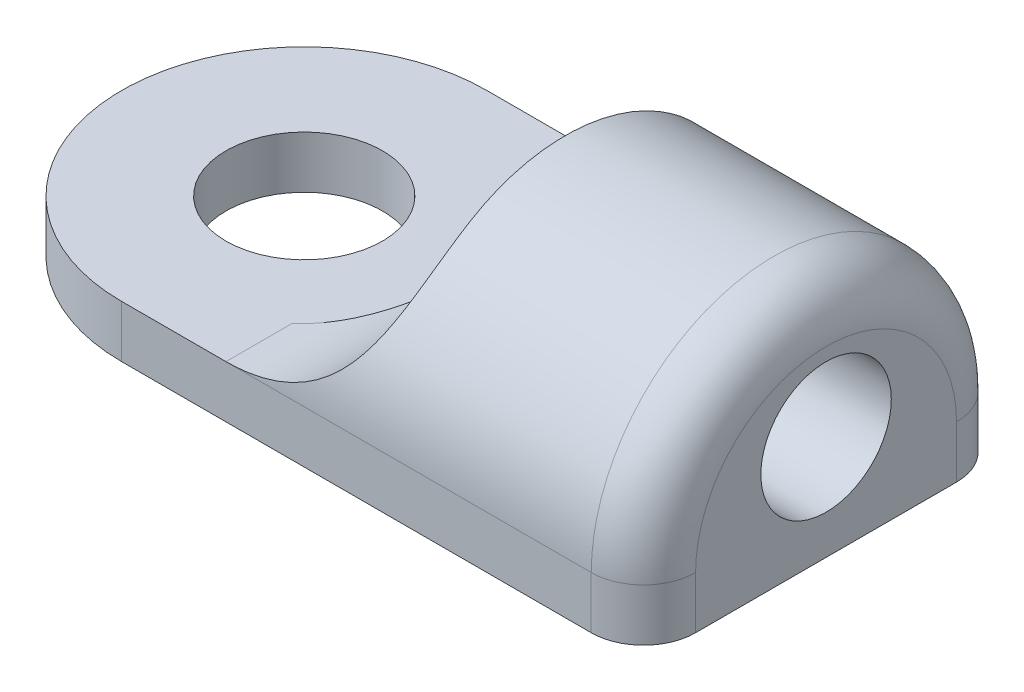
ISO-10303-21;
HEADER;
FILE_DESCRIPTION(('STEP AP214'),'2;1');
FILE_NAME('part.step','',(''),(''),'','','');
FILE_SCHEMA(('AUTOMOTIVE_DESIGN { 1 0 10303 214 1 1 1 1 }'));
ENDSEC;
DATA;
#1=APPLICATION_CONTEXT('core data for automotive mechanical design processes');
#2=APPLICATION_PROTOCOL_DEFINITION('international standard','automotive_design',2000,#1);
#3=PRODUCT_CONTEXT('',#1,'mechanical');
#4=PRODUCT('Part','Part','',(#3));
#5=PRODUCT_RELATED_PRODUCT_CATEGORY('part','',(#4));
#6=PRODUCT_DEFINITION_FORMATION('','',#4);
#7=PRODUCT_DEFINITION_CONTEXT('part definition',#1,'design');
#8=PRODUCT_DEFINITION('design','',#6,#7);
#9=PRODUCT_DEFINITION_SHAPE('','',#8);
#10=(LENGTH_UNIT() NAMED_UNIT(*) SI_UNIT(.MILLI.,.METRE.));
#11=(NAMED_UNIT(*) PLANE_ANGLE_UNIT() SI_UNIT($,.RADIAN.));
#12=(NAMED_UNIT(*) SI_UNIT($,.STERADIAN.) SOLID_ANGLE_UNIT());
#13=UNCERTAINTY_MEASURE_WITH_UNIT(LENGTH_MEASURE(1.E-05),#10,'distance_accuracy_value','');
#14=(GEOMETRIC_REPRESENTATION_CONTEXT(3) GLOBAL_UNCERTAINTY_ASSIGNED_CONTEXT((#13)) GLOBAL_UNIT_ASSIGNED_CONTEXT((#10,
#11,#12)) REPRESENTATION_CONTEXT('',''));
#15=CARTESIAN_POINT('',(0.,0.,0.));
#16=DIRECTION('',(0.,0.,1.));
#17=DIRECTION('',(1.,0.,0.));
#18=AXIS2_PLACEMENT_3D('',#15,#16,#17);
#19=CARTESIAN_POINT('',(1.99999999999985,4.,0.));
#20=DIRECTION('',(0.,0.,-1.));
#21=DIRECTION('',(-1.,0.,0.));
#22=AXIS2_PLACEMENT_3D('',#19,#20,#21);
#23=CYLINDRICAL_SURFACE('',#22,3.);
#24=CARTESIAN_POINT('',(1.80565399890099,1.00630167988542,2.39862057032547));
#25=CARTESIAN_POINT('',(1.88048617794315,1.00142895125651,2.34010039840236));
#26=CARTESIAN_POINT('',(1.95326958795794,0.99953534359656,2.27877300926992));
#27=CARTESIAN_POINT('',(2.09390884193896,1.00065013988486,2.15080450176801));
#28=CARTESIAN_POINT('',(2.16176697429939,1.00365625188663,2.08416588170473));
#29=CARTESIAN_POINT('',(2.29210998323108,1.01353538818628,1.94548751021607));
#30=CARTESIAN_POINT('',(2.35456743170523,1.02042695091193,1.87342331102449));
#31=CARTESIAN_POINT('',(2.47304514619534,1.03692570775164,1.724505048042));
#32=CARTESIAN_POINT('',(2.52906512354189,1.04653302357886,1.64765076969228));
#33=CARTESIAN_POINT('',(2.68003431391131,1.07637150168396,1.4200797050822));
#34=CARTESIAN_POINT('',(2.76614222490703,1.09854145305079,1.26358923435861));
#35=CARTESIAN_POINT('',(2.9086596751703,1.13994502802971,0.937724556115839));
#36=CARTESIAN_POINT('',(2.965173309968,1.15918877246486,0.768397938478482));
#37=CARTESIAN_POINT('',(3.0361270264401,1.18441005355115,0.457212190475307));
#38=CARTESIAN_POINT('',(3.05686899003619,1.19231314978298,0.316955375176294));
#39=CARTESIAN_POINT('',(3.07564437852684,1.19944410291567,0.0347076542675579));
#40=CARTESIAN_POINT('',(3.07368764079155,1.19867571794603,-0.107282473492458));
#41=CARTESIAN_POINT('',(3.04725546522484,1.18869562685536,-0.388533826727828));
#42=CARTESIAN_POINT('',(3.02281900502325,1.1794985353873,-0.527799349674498));
#43=CARTESIAN_POINT('',(2.95315462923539,1.15520993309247,-0.800533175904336));
#44=CARTESIAN_POINT('',(2.90790397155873,1.14011197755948,-0.933994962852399));
#45=CARTESIAN_POINT('',(2.79527147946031,1.10669713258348,-1.20140234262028));
#46=CARTESIAN_POINT('',(2.72661640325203,1.08823282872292,-1.33478816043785));
#47=CARTESIAN_POINT('',(2.57098893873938,1.05376235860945,-1.59065760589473));
#48=CARTESIAN_POINT('',(2.48401893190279,1.03775587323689,-1.71314264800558));
#49=CARTESIAN_POINT('',(2.30336214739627,1.01412535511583,-1.93489098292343));
#50=CARTESIAN_POINT('',(2.21111547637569,1.00584553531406,-2.03525481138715));
#51=CARTESIAN_POINT('',(2.06469619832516,1.0002990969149,-2.17768874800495));
#52=CARTESIAN_POINT('',(2.01454068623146,0.999596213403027,-2.22382061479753));
#53=CARTESIAN_POINT('',(1.91182496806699,1.00085563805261,-2.31331794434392));
#54=CARTESIAN_POINT('',(1.85926400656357,1.0028187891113,-2.35668252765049));
#55=CARTESIAN_POINT('',(1.80565399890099,1.00630167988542,-2.39862057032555));
#56=B_SPLINE_CURVE_WITH_KNOTS('',3,(#24,#25,#26,#27,#28,#29,#30,#31,#32,#33,#34,#35,#36,#37,#38,
#39,#40,#41,#42,#43,#44,#45,#46,#47,#48,#49,#50,#51,#52,#53,#54,#55),.UNSPECIFIED.,.F.,.F.,(4,2,
2,2,2,2,2,2,2,2,2,2,2,2,2,4),(0.,0.285203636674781,0.570273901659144,0.856715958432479,
1.14317085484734,1.68034204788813,2.21561087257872,2.63967088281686,3.06354711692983,
3.48668977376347,3.91029586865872,4.36211458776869,4.81387459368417,5.22238574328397,
5.42669819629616,5.63107526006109),.UNSPECIFIED.);
#57=CARTESIAN_POINT('',(2.,0.999999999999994,2.23606797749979));
#58=VERTEX_POINT('',#57);
#59=CARTESIAN_POINT('',(2.,0.999999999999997,-2.23606797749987));
#60=VERTEX_POINT('',#59);
#61=EDGE_CURVE('E106',#58,#60,#56,.T.);
#62=ORIENTED_EDGE('',*,*,#61,.F.);
#63=DIRECTION('',(0.,0.,-1.));
#64=VECTOR('',#63,1.);
#65=CARTESIAN_POINT('',(2.,0.999999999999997,0.));
#66=LINE('',#65,#64);
#67=CARTESIAN_POINT('',(2.,0.999999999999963,3.5));
#68=VERTEX_POINT('',#67);
#69=EDGE_CURVE('E117',#68,#58,#66,.T.);
#70=ORIENTED_EDGE('',*,*,#69,.F.);
#71=CARTESIAN_POINT('',(4.99999999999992,4.,1.80277563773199));
#72=CARTESIAN_POINT('',(4.99999442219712,3.9576820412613,1.87321692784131));
#73=CARTESIAN_POINT('',(4.99910426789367,3.91285624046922,1.94217352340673));
#74=CARTESIAN_POINT('',(4.99487733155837,3.81847183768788,2.07676644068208));
#75=CARTESIAN_POINT('',(4.99153862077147,3.76890953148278,2.14240010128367));
#76=CARTESIAN_POINT('',(4.98170444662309,3.66508047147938,2.2702808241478));
#77=CARTESIAN_POINT('',(4.97518945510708,3.61078634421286,2.33250425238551));
#78=CARTESIAN_POINT('',(4.95828761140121,3.49823110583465,2.45267502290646));
#79=CARTESIAN_POINT('',(4.94790172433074,3.43997098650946,2.51062342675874));
#80=CARTESIAN_POINT('',(4.9224891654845,3.31966175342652,2.62220196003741));
#81=CARTESIAN_POINT('',(4.90743254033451,3.25759032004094,2.67580131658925));
#82=CARTESIAN_POINT('',(4.87206691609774,3.13076888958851,2.77784915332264));
#83=CARTESIAN_POINT('',(4.8517586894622,3.06601928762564,2.8262983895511));
#84=CARTESIAN_POINT('',(4.8054536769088,2.93499388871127,2.91755864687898));
#85=CARTESIAN_POINT('',(4.77947874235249,2.86872480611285,2.96039034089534));
#86=CARTESIAN_POINT('',(4.72143855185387,2.73546449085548,3.04042789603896));
#87=CARTESIAN_POINT('',(4.68937428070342,2.66847337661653,3.07763466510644));
#88=CARTESIAN_POINT('',(4.62327625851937,2.54300946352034,3.14220940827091));
#89=CARTESIAN_POINT('',(4.58995621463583,2.48449148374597,3.17022362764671));
#90=CARTESIAN_POINT('',(4.51849747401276,2.36849391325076,3.22199620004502));
#91=CARTESIAN_POINT('',(4.48035723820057,2.31101466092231,3.2457531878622));
#92=CARTESIAN_POINT('',(4.39936469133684,2.19780876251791,3.28921467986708));
#93=CARTESIAN_POINT('',(4.35650928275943,2.14208329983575,3.30891649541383));
#94=CARTESIAN_POINT('',(4.26633150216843,2.03308427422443,3.34455222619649));
#95=CARTESIAN_POINT('',(4.21900738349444,1.97981168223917,3.36048465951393));
#96=CARTESIAN_POINT('',(4.07489047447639,1.82892670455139,3.40197545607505));
#97=CARTESIAN_POINT('',(3.97245792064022,1.735349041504,3.42300086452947));
#98=CARTESIAN_POINT('',(3.75477960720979,1.56276831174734,3.45558120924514));
#99=CARTESIAN_POINT('',(3.63953242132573,1.48376687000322,3.46713509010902));
#100=CARTESIAN_POINT('',(3.38742892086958,1.33572381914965,3.4847338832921));
#101=CARTESIAN_POINT('',(3.24955974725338,1.2683312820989,3.49015428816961));
#102=CARTESIAN_POINT('',(2.96507876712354,1.15534589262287,3.49701235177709));
#103=CARTESIAN_POINT('',(2.81846646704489,1.10975427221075,3.49844978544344));
#104=CARTESIAN_POINT('',(2.55951164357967,1.05048514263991,3.49972289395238));
#105=CARTESIAN_POINT('',(2.44834887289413,1.03155828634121,3.4998814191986));
#106=CARTESIAN_POINT('',(2.28066082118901,1.01262814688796,3.4999824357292));
#107=CARTESIAN_POINT('',(2.22464202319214,1.00789480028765,3.49999334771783));
#108=CARTESIAN_POINT('',(2.1124185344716,1.00158016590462,3.50000023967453));
#109=CARTESIAN_POINT('',(2.05621381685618,0.999999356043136,3.49999621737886));
#110=CARTESIAN_POINT('',(2.,0.999999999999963,3.5));
#111=B_SPLINE_CURVE_WITH_KNOTS('',3,(#71,#72,#73,#74,#75,#76,#77,#78,#79,#80,#81,#82,#83,#84,
#85,#86,#87,#88,#89,#90,#91,#92,#93,#94,#95,#96,#97,#98,#99,#100,#101,#102,#103,#104,#105,#106,
#107,#108,#109,#110),.UNSPECIFIED.,.F.,.F.,(4,2,2,2,2,2,2,2,2,2,2,2,2,2,2,2,2,2,2,4),(0.,
0.246499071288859,0.493192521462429,0.741422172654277,0.989589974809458,1.2393833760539,
1.48914005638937,1.73795015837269,1.98672005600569,2.20523703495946,2.42382396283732,
2.64255535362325,2.8613725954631,3.2804260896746,3.69952627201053,4.15827123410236,
4.61704211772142,4.95460521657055,5.12318077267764,5.29178188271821),.UNSPECIFIED.);
#112=CARTESIAN_POINT('',(4.99999999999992,4.,1.80277563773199));
#113=VERTEX_POINT('',#112);
#114=EDGE_CURVE('E121',#113,#68,#111,.T.);
#115=ORIENTED_EDGE('',*,*,#114,.F.);
#116=DIRECTION('',(0.,0.,-1.));
#117=VECTOR('',#116,1.);
#118=CARTESIAN_POINT('',(4.99999999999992,4.,0.));
#119=LINE('',#118,#117);
#120=CARTESIAN_POINT('',(4.99999999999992,4.,-1.80277563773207));
#121=VERTEX_POINT('',#120);
#122=EDGE_CURVE('E129',#121,#113,#119,.F.);
#123=ORIENTED_EDGE('',*,*,#122,.F.);
#124=CARTESIAN_POINT('',(2.,0.999999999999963,-3.50000000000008));
#125=CARTESIAN_POINT('',(2.08374239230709,0.999991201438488,-3.49997769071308));
#126=CARTESIAN_POINT('',(2.16748354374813,1.00350602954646,-3.49999929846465));
#127=CARTESIAN_POINT('',(2.3343781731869,1.01751957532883,-3.49996912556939));
#128=CARTESIAN_POINT('',(2.41753166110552,1.0280181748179,-3.49991734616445));
#129=CARTESIAN_POINT('',(2.58275778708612,1.05595097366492,-3.49957900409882));
#130=CARTESIAN_POINT('',(2.66482916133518,1.07339264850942,-3.49929218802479));
#131=CARTESIAN_POINT('',(2.8272195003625,1.11508510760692,-3.49816993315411));
#132=CARTESIAN_POINT('',(2.90753848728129,1.1393358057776,-3.4973345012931));
#133=CARTESIAN_POINT('',(3.06592847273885,1.19449898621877,-3.49470056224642));
#134=CARTESIAN_POINT('',(3.14399721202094,1.22541791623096,-3.49290112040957));
#135=CARTESIAN_POINT('',(3.29722876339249,1.2936683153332,-3.48782588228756));
#136=CARTESIAN_POINT('',(3.37239170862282,1.33099949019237,-3.48455015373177));
#137=CARTESIAN_POINT('',(3.51921798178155,1.41175851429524,-3.47593190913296));
#138=CARTESIAN_POINT('',(3.59088239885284,1.45518444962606,-3.47059004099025));
#139=CARTESIAN_POINT('',(3.73012096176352,1.5477227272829,-3.45719295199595));
#140=CARTESIAN_POINT('',(3.79769745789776,1.59683175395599,-3.44913930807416));
#141=CARTESIAN_POINT('',(3.9263535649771,1.6987607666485,-3.4299189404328));
#142=CARTESIAN_POINT('',(3.9875641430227,1.75143337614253,-3.41884842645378));
#143=CARTESIAN_POINT('',(4.10509643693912,1.86106968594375,-3.39289392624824));
#144=CARTESIAN_POINT('',(4.16142054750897,1.91803125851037,-3.37801182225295));
#145=CARTESIAN_POINT('',(4.268718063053,2.03550461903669,-3.34387017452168));
#146=CARTESIAN_POINT('',(4.31969492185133,2.09601407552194,-3.32461348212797));
#147=CARTESIAN_POINT('',(4.41595914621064,2.21975187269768,-3.28123453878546));
#148=CARTESIAN_POINT('',(4.46124721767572,2.2829798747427,-3.25711289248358));
#149=CARTESIAN_POINT('',(4.54138911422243,2.40436324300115,-3.20649609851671));
#150=CARTESIAN_POINT('',(4.57684029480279,2.46234403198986,-3.18052523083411));
#151=CARTESIAN_POINT('',(4.64294785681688,2.57897185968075,-3.12426641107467));
#152=CARTESIAN_POINT('',(4.67360268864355,2.63761910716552,-3.09397706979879));
#153=CARTESIAN_POINT('',(4.73013321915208,2.75476929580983,-3.02906963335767));
#154=CARTESIAN_POINT('',(4.75601170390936,2.81327230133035,-2.99445408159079));
#155=CARTESIAN_POINT('',(4.80318704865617,2.9294485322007,-2.92095298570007));
#156=CARTESIAN_POINT('',(4.82448218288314,2.98712143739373,-2.8820658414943));
#157=CARTESIAN_POINT('',(4.88028871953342,3.15315013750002,-2.76259678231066));
#158=CARTESIAN_POINT('',(4.90903309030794,3.25952931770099,-2.6764570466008));
#159=CARTESIAN_POINT('',(4.95335646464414,3.46282096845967,-2.4906899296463));
#160=CARTESIAN_POINT('',(4.96892371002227,3.55972491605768,-2.39105059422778));
#161=CARTESIAN_POINT('',(4.98719579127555,3.71549059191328,-2.21043366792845));
#162=CARTESIAN_POINT('',(4.99230048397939,3.77732968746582,-2.13221656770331));
#163=CARTESIAN_POINT('',(4.99869000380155,3.89398633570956,-1.97097420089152));
#164=CARTESIAN_POINT('',(4.99998815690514,3.94882773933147,-1.8879667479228));
#165=CARTESIAN_POINT('',(4.99999999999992,4.,-1.80277563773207));
#166=B_SPLINE_CURVE_WITH_KNOTS('',3,(#124,#125,#126,#127,#128,#129,#130,#131,#132,#133,#134,
#135,#136,#137,#138,#139,#140,#141,#142,#143,#144,#145,#146,#147,#148,#149,#150,#151,#152,#153,
#154,#155,#156,#157,#158,#159,#160,#161,#162,#163,#164,#165),.UNSPECIFIED.,.F.,.F.,(4,2,2,2,2,2,
2,2,2,2,2,2,2,2,2,2,2,2,2,2,4),(0.,0.251151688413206,0.502299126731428,0.753717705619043,
1.00513310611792,1.25679270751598,1.50844076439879,1.76000997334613,2.01143314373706,
2.25562425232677,2.49969500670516,2.74360713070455,2.98748895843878,3.20546534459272,
3.42351200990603,3.6414310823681,3.85943206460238,4.27716692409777,4.69527414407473,
4.994375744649,5.29242898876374),.UNSPECIFIED.);
#167=CARTESIAN_POINT('',(2.,0.999999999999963,-3.50000000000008));
#168=VERTEX_POINT('',#167);
#169=EDGE_CURVE('E131',#168,#121,#166,.T.);
#170=ORIENTED_EDGE('',*,*,#169,.F.);
#171=EDGE_CURVE('E119',#60,#168,#66,.T.);
#172=ORIENTED_EDGE('',*,*,#171,.F.);
#173=EDGE_LOOP('',(#62,#70,#115,#123,#170,#172));
#174=FACE_BOUND('',#173,.T.);
#175=ADVANCED_FACE('F32',(#174),#23,.F.);
#176=CARTESIAN_POINT('',(0.,1.,0.));
#177=DIRECTION('',(0.,1.,0.));
#178=DIRECTION('',(0.,0.,1.));
#179=AXIS2_PLACEMENT_3D('',#176,#177,#178);
#180=PLANE('',#179);
#181=ORIENTED_EDGE('',*,*,#69,.T.);
#182=CARTESIAN_POINT('',(0.,1.,0.));
#183=DIRECTION('',(0.,1.,0.));
#184=DIRECTION('',(0.,0.,1.));
#185=AXIS2_PLACEMENT_3D('',#182,#183,#184);
#186=CIRCLE('',#185,3.);
#187=EDGE_CURVE('E103',#58,#60,#186,.T.);
#188=ORIENTED_EDGE('',*,*,#187,.T.);
#189=ORIENTED_EDGE('',*,*,#171,.T.);
#190=DIRECTION('',(-1.,0.,0.));
#191=VECTOR('',#190,1.);
#192=CARTESIAN_POINT('',(0.,1.,-3.50000000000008));
#193=LINE('',#192,#191);
#194=CARTESIAN_POINT('',(0.,1.,-3.50000000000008));
#195=VERTEX_POINT('',#194);
#196=EDGE_CURVE('E344',#168,#195,#193,.T.);
#197=ORIENTED_EDGE('',*,*,#196,.T.);
#198=CARTESIAN_POINT('',(0.,1.,0.));
#199=DIRECTION('',(0.,1.,0.));
#200=DIRECTION('',(0.,0.,1.));
#201=AXIS2_PLACEMENT_3D('',#198,#199,#200);
#202=CIRCLE('',#201,3.5);
#203=CARTESIAN_POINT('',(0.,1.,3.5));
#204=VERTEX_POINT('',#203);
#205=EDGE_CURVE('E334',#195,#204,#202,.T.);
#206=ORIENTED_EDGE('',*,*,#205,.T.);
#207=DIRECTION('',(1.,0.,0.));
#208=VECTOR('',#207,1.);
#209=CARTESIAN_POINT('',(0.,1.,3.5));
#210=LINE('',#209,#208);
#211=EDGE_CURVE('E127',#204,#68,#210,.T.);
#212=ORIENTED_EDGE('',*,*,#211,.T.);
#213=EDGE_LOOP('',(#181,#188,#189,#197,#206,#212));
#214=FACE_BOUND('',#213,.T.);
#215=CARTESIAN_POINT('',(0.,1.,0.));
#216=DIRECTION('',(0.,1.,0.));
#217=DIRECTION('',(0.,0.,1.));
#218=AXIS2_PLACEMENT_3D('',#215,#216,#217);
#219=CIRCLE('',#218,1.5);
#220=CARTESIAN_POINT('',(0.,1.,1.50000000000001));
#221=VERTEX_POINT('',#220);
#222=EDGE_CURVE('E348',#221,#221,#219,.T.);
#223=ORIENTED_EDGE('',*,*,#222,.F.);
#224=EDGE_LOOP('',(#223));
#225=FACE_BOUND('',#224,.T.);
#226=ADVANCED_FACE('F124',(#214,#225),#180,.T.);
#227=CARTESIAN_POINT('',(0.,0.,0.));
#228=DIRECTION('',(0.,1.,0.));
#229=DIRECTION('',(0.,0.,1.));
#230=AXIS2_PLACEMENT_3D('',#227,#228,#229);
#231=PLANE('',#230);
#232=DIRECTION('',(-1.,0.,0.));
#233=VECTOR('',#232,1.);
#234=CARTESIAN_POINT('',(0.,0.,-3.50000000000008));
#235=LINE('',#234,#233);
#236=CARTESIAN_POINT('',(9.,0.,-3.50000000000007));
#237=VERTEX_POINT('',#236);
#238=CARTESIAN_POINT('',(0.,0.,-3.50000000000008));
#239=VERTEX_POINT('',#238);
#240=EDGE_CURVE('E325',#237,#239,#235,.T.);
#241=ORIENTED_EDGE('',*,*,#240,.F.);
#242=CARTESIAN_POINT('',(9.,0.,-2.50000000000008));
#243=DIRECTION('',(0.,1.,0.));
#244=DIRECTION('',(0.,0.,1.));
#245=AXIS2_PLACEMENT_3D('',#242,#243,#244);
#246=CIRCLE('',#245,1.);
#247=CARTESIAN_POINT('',(9.99999999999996,0.,-2.50000000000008));
#248=VERTEX_POINT('',#247);
#249=EDGE_CURVE('E313',#237,#248,#246,.F.);
#250=ORIENTED_EDGE('',*,*,#249,.T.);
#251=DIRECTION('',(0.,0.,-1.));
#252=VECTOR('',#251,1.);
#253=CARTESIAN_POINT('',(9.99999999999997,0.,-3.50000000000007));
#254=LINE('',#253,#252);
#255=CARTESIAN_POINT('',(9.99999999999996,0.,2.5));
#256=VERTEX_POINT('',#255);
#257=EDGE_CURVE('E335',#256,#248,#254,.T.);
#258=ORIENTED_EDGE('',*,*,#257,.F.);
#259=CARTESIAN_POINT('',(9.,0.,2.5));
#260=DIRECTION('',(0.,1.,0.));
#261=DIRECTION('',(0.,0.,1.));
#262=AXIS2_PLACEMENT_3D('',#259,#260,#261);
#263=CIRCLE('',#262,1.);
#264=CARTESIAN_POINT('',(9.,0.,3.5));
#265=VERTEX_POINT('',#264);
#266=EDGE_CURVE('E315',#256,#265,#263,.F.);
#267=ORIENTED_EDGE('',*,*,#266,.T.);
#268=DIRECTION('',(1.,0.,0.));
#269=VECTOR('',#268,1.);
#270=CARTESIAN_POINT('',(0.,0.,3.5));
#271=LINE('',#270,#269);
#272=CARTESIAN_POINT('',(0.,0.,3.5));
#273=VERTEX_POINT('',#272);
#274=EDGE_CURVE('E338',#273,#265,#271,.T.);
#275=ORIENTED_EDGE('',*,*,#274,.F.);
#276=CARTESIAN_POINT('',(0.,0.,0.));
#277=DIRECTION('',(0.,1.,0.));
#278=DIRECTION('',(0.,0.,1.));
#279=AXIS2_PLACEMENT_3D('',#276,#277,#278);
#280=CIRCLE('',#279,3.5);
#281=EDGE_CURVE('E333',#239,#273,#280,.T.);
#282=ORIENTED_EDGE('',*,*,#281,.F.);
#283=EDGE_LOOP('',(#241,#250,#258,#267,#275,#282));
#284=FACE_BOUND('',#283,.T.);
#285=CARTESIAN_POINT('',(0.,0.,0.));
#286=DIRECTION('',(0.,1.,0.));
#287=DIRECTION('',(0.,0.,1.));
#288=AXIS2_PLACEMENT_3D('',#285,#286,#287);
#289=CIRCLE('',#288,1.5);
#290=CARTESIAN_POINT('',(0.,0.,1.50000000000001));
#291=VERTEX_POINT('',#290);
#292=EDGE_CURVE('E354',#291,#291,#289,.T.);
#293=ORIENTED_EDGE('',*,*,#292,.T.);
#294=EDGE_LOOP('',(#293));
#295=FACE_BOUND('',#294,.T.);
#296=ADVANCED_FACE('F167',(#284,#295),#231,.F.);
#297=CARTESIAN_POINT('',(0.,1.,0.));
#298=DIRECTION('',(0.,-1.,0.));
#299=DIRECTION('',(0.,0.,-1.));
#300=AXIS2_PLACEMENT_3D('',#297,#298,#299);
#301=CYLINDRICAL_SURFACE('',#300,3.5);
#302=ORIENTED_EDGE('',*,*,#281,.T.);
#303=DIRECTION('',(0.,-1.,0.));
#304=VECTOR('',#303,1.);
#305=CARTESIAN_POINT('',(0.,1.,3.5));
#306=LINE('',#305,#304);
#307=EDGE_CURVE('E133',#204,#273,#306,.T.);
#308=ORIENTED_EDGE('',*,*,#307,.F.);
#309=ORIENTED_EDGE('',*,*,#205,.F.);
#310=DIRECTION('',(0.,-1.,0.));
#311=VECTOR('',#310,1.);
#312=CARTESIAN_POINT('',(0.,1.,-3.50000000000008));
#313=LINE('',#312,#311);
#314=EDGE_CURVE('E341',#195,#239,#313,.T.);
#315=ORIENTED_EDGE('',*,*,#314,.T.);
#316=EDGE_LOOP('',(#302,#308,#309,#315));
#317=FACE_BOUND('',#316,.T.);
#318=ADVANCED_FACE('F170',(#317),#301,.T.);
#319=CARTESIAN_POINT('',(0.,1.,3.5));
#320=DIRECTION('',(0.,0.,-1.));
#321=DIRECTION('',(-1.,0.,0.));
#322=AXIS2_PLACEMENT_3D('',#319,#320,#321);
#323=PLANE('',#322);
#324=ORIENTED_EDGE('',*,*,#274,.T.);
#325=DIRECTION('',(0.,-1.,0.));
#326=VECTOR('',#325,1.);
#327=CARTESIAN_POINT('',(9.,0.999999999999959,3.5));
#328=LINE('',#327,#326);
#329=CARTESIAN_POINT('',(9.,0.999999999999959,3.5));
#330=VERTEX_POINT('',#329);
#331=EDGE_CURVE('E41',#265,#330,#328,.F.);
#332=ORIENTED_EDGE('',*,*,#331,.T.);
#333=DIRECTION('',(1.,0.,0.));
#334=VECTOR('',#333,1.);
#335=CARTESIAN_POINT('',(5.,1.,3.5));
#336=LINE('',#335,#334);
#337=EDGE_CURVE('E352',#68,#330,#336,.T.);
#338=ORIENTED_EDGE('',*,*,#337,.F.);
#339=ORIENTED_EDGE('',*,*,#211,.F.);
#340=ORIENTED_EDGE('',*,*,#307,.T.);
#341=EDGE_LOOP('',(#324,#332,#338,#339,#340));
#342=FACE_BOUND('',#341,.T.);
#343=ADVANCED_FACE('F178',(#342),#323,.F.);
#344=CARTESIAN_POINT('',(9.99999999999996,0.999999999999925,-3.50000000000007));
#345=DIRECTION('',(-1.,0.,0.));
#346=DIRECTION('',(0.,0.,1.));
#347=AXIS2_PLACEMENT_3D('',#344,#345,#346);
#348=PLANE('',#347);
#349=ORIENTED_EDGE('',*,*,#257,.T.);
#350=DIRECTION('',(0.,-1.,0.));
#351=VECTOR('',#350,1.);
#352=CARTESIAN_POINT('',(9.99999999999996,0.999999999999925,-2.50000000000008));
#353=LINE('',#352,#351);
#354=CARTESIAN_POINT('',(9.99999999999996,0.999999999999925,-2.50000000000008));
#355=VERTEX_POINT('',#354);
#356=EDGE_CURVE('E302',#248,#355,#353,.F.);
#357=ORIENTED_EDGE('',*,*,#356,.T.);
#358=CARTESIAN_POINT('',(9.99999999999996,0.999999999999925,0.));
#359=DIRECTION('',(-1.,0.,0.));
#360=DIRECTION('',(0.,0.,1.));
#361=AXIS2_PLACEMENT_3D('',#358,#359,#360);
#362=CIRCLE('',#361,2.5);
#363=CARTESIAN_POINT('',(9.99999999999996,0.999999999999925,2.5));
#364=VERTEX_POINT('',#363);
#365=EDGE_CURVE('E56',#355,#364,#362,.F.);
#366=ORIENTED_EDGE('',*,*,#365,.T.);
#367=DIRECTION('',(0.,-1.,0.));
#368=VECTOR('',#367,1.);
#369=CARTESIAN_POINT('',(9.99999999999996,0.999999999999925,2.5));
#370=LINE('',#369,#368);
#371=EDGE_CURVE('E310',#364,#256,#370,.T.);
#372=ORIENTED_EDGE('',*,*,#371,.T.);
#373=EDGE_LOOP('',(#349,#357,#366,#372));
#374=FACE_BOUND('',#373,.T.);
#375=CARTESIAN_POINT('',(10.,1.99999999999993,0.));
#376=DIRECTION('',(1.,0.,0.));
#377=DIRECTION('',(0.,0.,-1.));
#378=AXIS2_PLACEMENT_3D('',#375,#376,#377);
#379=CIRCLE('',#378,1.25);
#380=CARTESIAN_POINT('',(10.,1.99999999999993,-1.25000000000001));
#381=VERTEX_POINT('',#380);
#382=EDGE_CURVE('E306',#381,#381,#379,.T.);
#383=ORIENTED_EDGE('',*,*,#382,.F.);
#384=EDGE_LOOP('',(#383));
#385=FACE_BOUND('',#384,.T.);
#386=ADVANCED_FACE('F174',(#374,#385),#348,.F.);
#387=CARTESIAN_POINT('',(0.,1.,-3.50000000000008));
#388=DIRECTION('',(0.,0.,1.));
#389=DIRECTION('',(1.,0.,0.));
#390=AXIS2_PLACEMENT_3D('',#387,#388,#389);
#391=PLANE('',#390);
#392=CARTESIAN_POINT('',(9.,0.999999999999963,-3.50000000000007));
#393=VERTEX_POINT('',#392);
#394=EDGE_CURVE('E328',#393,#168,#193,.T.);
#395=ORIENTED_EDGE('',*,*,#394,.F.);
#396=DIRECTION('',(0.,-1.,0.));
#397=VECTOR('',#396,1.);
#398=CARTESIAN_POINT('',(9.,0.999999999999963,-3.50000000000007));
#399=LINE('',#398,#397);
#400=EDGE_CURVE('E120',#393,#237,#399,.T.);
#401=ORIENTED_EDGE('',*,*,#400,.T.);
#402=ORIENTED_EDGE('',*,*,#240,.T.);
#403=ORIENTED_EDGE('',*,*,#314,.F.);
#404=ORIENTED_EDGE('',*,*,#196,.F.);
#405=EDGE_LOOP('',(#395,#401,#402,#403,#404));
#406=FACE_BOUND('',#405,.T.);
#407=ADVANCED_FACE('F163',(#406),#391,.F.);
#408=CARTESIAN_POINT('',(0.,1.,0.));
#409=DIRECTION('',(0.,-1.,0.));
#410=DIRECTION('',(0.,0.,-1.));
#411=AXIS2_PLACEMENT_3D('',#408,#409,#410);
#412=CYLINDRICAL_SURFACE('',#411,1.5);
#413=ORIENTED_EDGE('',*,*,#222,.T.);
#414=EDGE_LOOP('',(#413));
#415=FACE_BOUND('',#414,.T.);
#416=ORIENTED_EDGE('',*,*,#292,.F.);
#417=EDGE_LOOP('',(#416));
#418=FACE_BOUND('',#417,.T.);
#419=ADVANCED_FACE('F157',(#415,#418),#412,.F.);
#420=CARTESIAN_POINT('',(5.,1.,0.));
#421=DIRECTION('',(1.,0.,0.));
#422=DIRECTION('',(0.,0.,-1.));
#423=AXIS2_PLACEMENT_3D('',#420,#421,#422);
#424=CYLINDRICAL_SURFACE('',#423,3.5);
#425=ORIENTED_EDGE('',*,*,#337,.T.);
#426=CARTESIAN_POINT('',(9.,0.999999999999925,0.));
#427=DIRECTION('',(-1.,0.,0.));
#428=DIRECTION('',(0.,0.,1.));
#429=AXIS2_PLACEMENT_3D('',#426,#427,#428);
#430=CIRCLE('',#429,3.5);
#431=EDGE_CURVE('E11',#330,#393,#430,.T.);
#432=ORIENTED_EDGE('',*,*,#431,.T.);
#433=ORIENTED_EDGE('',*,*,#394,.T.);
#434=ORIENTED_EDGE('',*,*,#169,.T.);
#435=CARTESIAN_POINT('',(5.,1.,0.));
#436=DIRECTION('',(1.,0.,0.));
#437=DIRECTION('',(0.,0.,-1.));
#438=AXIS2_PLACEMENT_3D('',#435,#436,#437);
#439=CIRCLE('',#438,3.5);
#440=EDGE_CURVE('E111',#121,#113,#439,.T.);
#441=ORIENTED_EDGE('',*,*,#440,.T.);
#442=ORIENTED_EDGE('',*,*,#114,.T.);
#443=EDGE_LOOP('',(#425,#432,#433,#434,#441,#442));
#444=FACE_BOUND('',#443,.T.);
#445=ADVANCED_FACE('F151',(#444),#424,.T.);
#446=CARTESIAN_POINT('',(5.,1.,0.));
#447=DIRECTION('',(1.,0.,0.));
#448=DIRECTION('',(0.,0.,-1.));
#449=AXIS2_PLACEMENT_3D('',#446,#447,#448);
#450=PLANE('',#449);
#451=ORIENTED_EDGE('',*,*,#440,.F.);
#452=ORIENTED_EDGE('',*,*,#122,.T.);
#453=EDGE_LOOP('',(#451,#452));
#454=FACE_BOUND('',#453,.T.);
#455=ADVANCED_FACE('F156',(#454),#450,.F.);
#456=CARTESIAN_POINT('',(0.,1.,0.));
#457=DIRECTION('',(0.,1.,0.));
#458=DIRECTION('',(0.,0.,1.));
#459=AXIS2_PLACEMENT_3D('',#456,#457,#458);
#460=CONICAL_SURFACE('',#459,3.,0.349065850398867);
#461=ORIENTED_EDGE('',*,*,#61,.T.);
#462=ORIENTED_EDGE('',*,*,#187,.F.);
#463=EDGE_LOOP('',(#461,#462));
#464=FACE_BOUND('',#463,.T.);
#465=ADVANCED_FACE('F105',(#464),#460,.F.);
#466=CARTESIAN_POINT('',(7.,2.,0.));
#467=DIRECTION('',(1.,0.,0.));
#468=DIRECTION('',(0.,0.,-1.));
#469=AXIS2_PLACEMENT_3D('',#466,#467,#468);
#470=CYLINDRICAL_SURFACE('',#469,1.25);
#471=CARTESIAN_POINT('',(7.,2.,0.));
#472=DIRECTION('',(1.,0.,0.));
#473=DIRECTION('',(0.,0.,-1.));
#474=AXIS2_PLACEMENT_3D('',#471,#472,#473);
#475=CIRCLE('',#474,1.25);
#476=CARTESIAN_POINT('',(7.,2.,-1.25000000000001));
#477=VERTEX_POINT('',#476);
#478=EDGE_CURVE('E112',#477,#477,#475,.T.);
#479=ORIENTED_EDGE('',*,*,#478,.F.);
#480=EDGE_LOOP('',(#479));
#481=FACE_BOUND('',#480,.T.);
#482=ORIENTED_EDGE('',*,*,#382,.T.);
#483=EDGE_LOOP('',(#482));
#484=FACE_BOUND('',#483,.T.);
#485=ADVANCED_FACE('F249',(#481,#484),#470,.F.);
#486=CARTESIAN_POINT('',(7.,2.,0.));
#487=DIRECTION('',(1.,0.,0.));
#488=DIRECTION('',(0.,0.,-1.));
#489=AXIS2_PLACEMENT_3D('',#486,#487,#488);
#490=PLANE('',#489);
#491=ORIENTED_EDGE('',*,*,#478,.T.);
#492=EDGE_LOOP('',(#491));
#493=FACE_BOUND('',#492,.T.);
#494=ADVANCED_FACE('F257',(#493),#490,.T.);
#495=CARTESIAN_POINT('',(9.,0.999999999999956,2.5));
#496=DIRECTION('',(0.,-1.,0.));
#497=DIRECTION('',(0.,0.,-1.));
#498=AXIS2_PLACEMENT_3D('',#495,#496,#497);
#499=CYLINDRICAL_SURFACE('',#498,1.);
#500=ORIENTED_EDGE('',*,*,#266,.F.);
#501=ORIENTED_EDGE('',*,*,#371,.F.);
#502=CARTESIAN_POINT('',(9.,0.999999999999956,2.5));
#503=DIRECTION('',(0.,1.,0.));
#504=DIRECTION('',(0.,0.,1.));
#505=AXIS2_PLACEMENT_3D('',#502,#503,#504);
#506=CIRCLE('',#505,1.);
#507=EDGE_CURVE('E36',#330,#364,#506,.T.);
#508=ORIENTED_EDGE('',*,*,#507,.F.);
#509=ORIENTED_EDGE('',*,*,#331,.F.);
#510=EDGE_LOOP('',(#500,#501,#508,#509));
#511=FACE_BOUND('',#510,.T.);
#512=ADVANCED_FACE('F34',(#511),#499,.T.);
#513=CARTESIAN_POINT('',(9.,0.999999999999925,0.));
#514=DIRECTION('',(-1.,0.,0.));
#515=DIRECTION('',(0.,0.,1.));
#516=AXIS2_PLACEMENT_3D('',#513,#514,#515);
#517=TOROIDAL_SURFACE('',#516,2.5,1.);
#518=ORIENTED_EDGE('',*,*,#507,.T.);
#519=ORIENTED_EDGE('',*,*,#365,.F.);
#520=CARTESIAN_POINT('',(9.,0.999999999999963,-2.50000000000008));
#521=DIRECTION('',(0.,-1.,0.));
#522=DIRECTION('',(0.,0.,-1.));
#523=AXIS2_PLACEMENT_3D('',#520,#521,#522);
#524=CIRCLE('',#523,1.);
#525=EDGE_CURVE('E301',#393,#355,#524,.T.);
#526=ORIENTED_EDGE('',*,*,#525,.F.);
#527=ORIENTED_EDGE('',*,*,#431,.F.);
#528=EDGE_LOOP('',(#518,#519,#526,#527));
#529=FACE_BOUND('',#528,.T.);
#530=ADVANCED_FACE('F276',(#529),#517,.T.);
#531=CARTESIAN_POINT('',(9.,0.999999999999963,-2.50000000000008));
#532=DIRECTION('',(0.,-1.,0.));
#533=DIRECTION('',(0.,0.,-1.));
#534=AXIS2_PLACEMENT_3D('',#531,#532,#533);
#535=CYLINDRICAL_SURFACE('',#534,1.);
#536=ORIENTED_EDGE('',*,*,#525,.T.);
#537=ORIENTED_EDGE('',*,*,#356,.F.);
#538=ORIENTED_EDGE('',*,*,#249,.F.);
#539=ORIENTED_EDGE('',*,*,#400,.F.);
#540=EDGE_LOOP('',(#536,#537,#538,#539));
#541=FACE_BOUND('',#540,.T.);
#542=ADVANCED_FACE('F285',(#541),#535,.T.);
#543=CLOSED_SHELL('',(#175,#226,#296,#318,#343,#386,#407,#419,#445,#455,#465,#485,#494,#512,
#530,#542));
#544=MANIFOLD_SOLID_BREP('B2',#543);
#545=ADVANCED_BREP_SHAPE_REPRESENTATION('',(#18,#544),#14);
#546=SHAPE_DEFINITION_REPRESENTATION(#9,#545);
ENDSEC;
END-ISO-10303-21;
